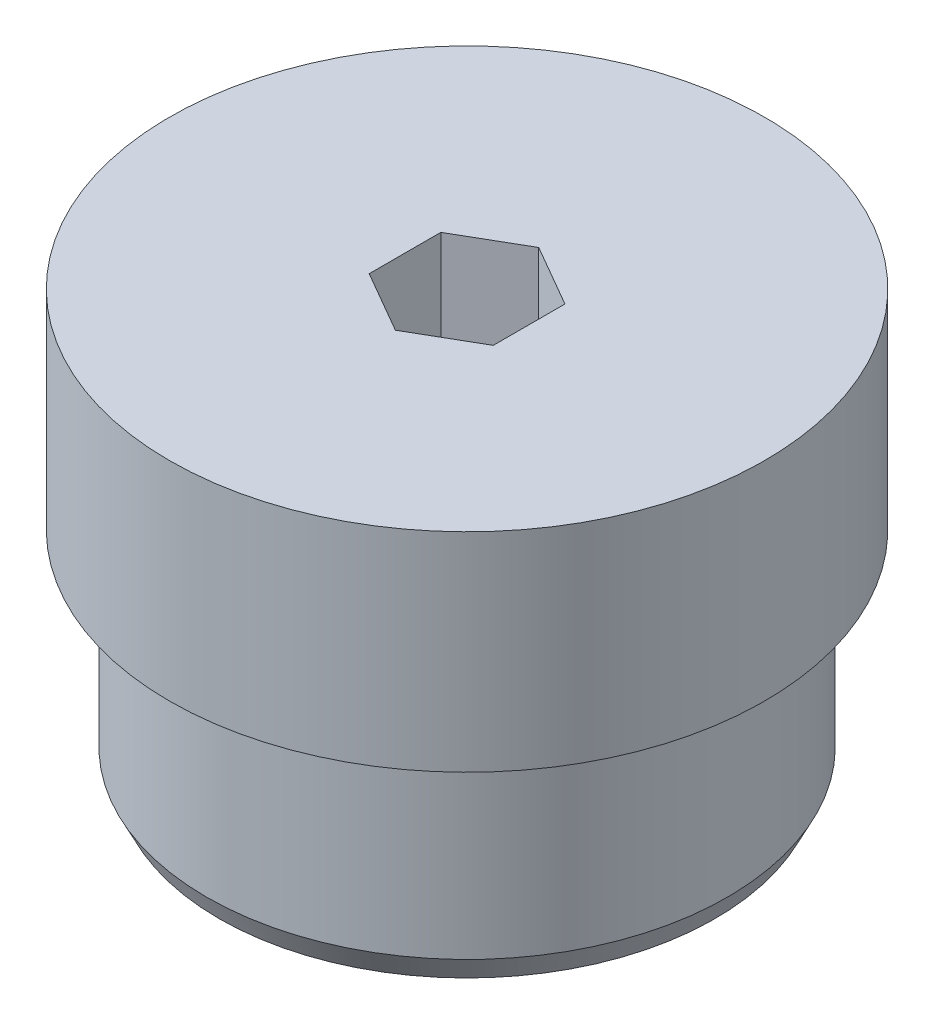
from build123d import *

# Parameters (mm, degrees)
ENL_V_MAT_EXTRU_1_DEPTH = 13.010412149


with BuildPart() as part:
    # Esquisse1 → Base-R_volution (revolve)
    with BuildSketch(Plane.XY, mode=Mode.PRIVATE) as base_r_volution_sk:
        Polygon((-4, 0), (-5, 0), (-5.25, 0.5), (-5.25, 4.3), (-6, 4.3), (-6, 8.5), (0, 8.5), (0, 5.704700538), (-2, 5.704700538), (-2, 3.104700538), (-4, 1.95), align=None)
    revolve(base_r_volution_sk.sketch.rotate(Axis((0, 30, 0), (0, -1, 0)), 270), axis=Axis((0, 30, 0), (0, -1, 0)))

    # Esquisse2 → Enl_v. mat.-Extru.1 (cut, through all)
    with BuildSketch(Plane(origin=(0, 8.5, 0), x_dir=(-1, 0, 0), z_dir=(0, 1, 0))):
        Polygon((0, 1.445), (-1.251406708, 0.7225), (-1.251406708, -0.7225), (0, -1.445), (1.251406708, -0.7225), (1.251406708, 0.7225), align=None)
    extrude(amount=-ENL_V_MAT_EXTRU_1_DEPTH, mode=Mode.SUBTRACT)


solid = part.part
